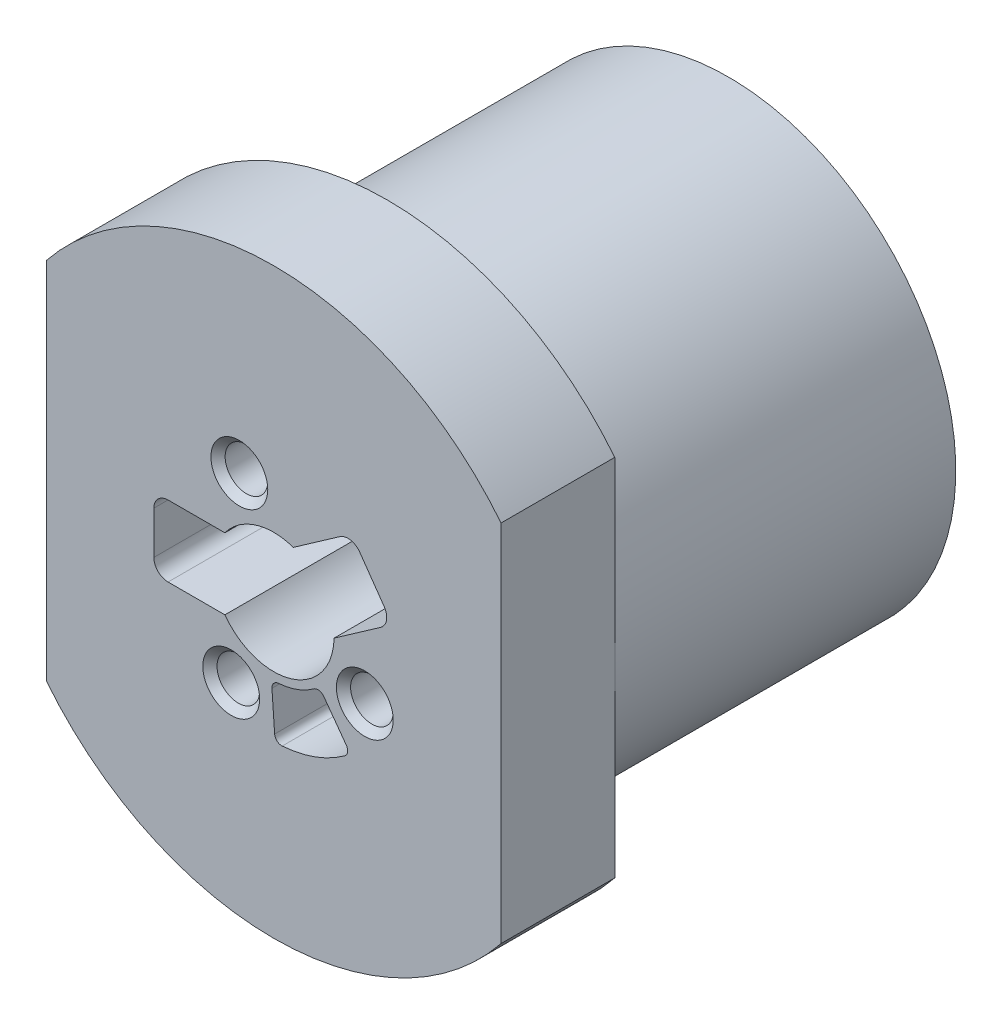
from build123d import *

# Parameters (mm, degrees)
ESQUISSE1_R             = 16
EXTRUSION1_DEPTH        = 24
ESQUISSE2_R             = 20.5
EXTRUSION2_DEPTH        = 8
ENL_V_START             = -8
ENL_V_MAT_EXTRU_1_DEPTH = 8
ENL_V_MAT_EXTRU_2_REACH = 43.234
ESQUISSE5_R             = 4
ENL_V_MAT_EXTRU_3_REACH = 43.234
ENL_V_MAT_EXTRU_4_DEPTH = 20
ENL_V_MAT_EXTRU_5_REACH = 43.234
ESQUISSE8_R             = 1.5
CHANFREIN1_SIZE         = 0.5
EXTRUSION3_START        = 4.36
EXTRUSION3_DEPTH        = 4.36


with BuildPart() as part:
    # Esquisse1 → Extrusion1 (new body)
    with BuildSketch(Plane.XY):
        Circle(ESQUISSE1_R)
    extrude(amount=EXTRUSION1_DEPTH)

    # Esquisse2 → Extrusion2 (add)
    with BuildSketch(Plane.XY.offset(24)):
        Circle(ESQUISSE2_R)
    extrude(amount=EXTRUSION2_DEPTH)

    # Esquisse4 → Enl_v. mat.-Extru.1 (cut)
    with BuildSketch(Plane.XY.offset(32).offset(ENL_V_START)):
        with BuildLine():
            Line((-16, 12.816005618), (-16, -12.816005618))
            ThreePointArc((-16, -12.816005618), (-20.5, 0), (-16, 12.816005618))
        make_face()
        with BuildLine():
            Line((16, 12.816005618), (16, -12.816005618))
            ThreePointArc((16, -12.816005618), (20.5, 0), (16, 12.816005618))
        make_face()
    extrude(amount=ENL_V_MAT_EXTRU_1_DEPTH, mode=Mode.SUBTRACT)

    # Esquisse5 → Enl_v. mat.-Extru.2 (cut, up to next)
    with BuildSketch(Plane(origin=(0, 0, 0), x_dir=(-1, 0, 0), z_dir=(0, 0, -1)), mode=Mode.PRIVATE) as enl_v_mat_extru_2_sk1:
        Circle(ESQUISSE5_R)
    enl_v_mat_extru_2_tool1 = extrude(enl_v_mat_extru_2_sk1.sketch, amount=-ENL_V_MAT_EXTRU_2_REACH, mode=Mode.PRIVATE) & part.part
    add(enl_v_mat_extru_2_tool1.solids().sort_by_distance((0, 0, 0))[0], mode=Mode.SUBTRACT)

    # Esquisse6 → Enl_v. mat.-Extru.3 (cut, up to next)
    with BuildSketch(Plane(origin=(0, 0, 0), x_dir=(-1, 0, 0), z_dir=(0, 0, -1)), mode=Mode.PRIVATE) as enl_v_mat_extru_3_sk1:
        with BuildLine():
            Line((-4.705067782, -6.470111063), (-3.117107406, -4.286448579))
            ThreePointArc((-3.117107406, -4.286448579), (-1.814850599, -4.979590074), (-0.371985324, -5.28692982))
            Line((-0.371985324, -5.28692982), (-0.561487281, -7.980271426))
            ThreePointArc((-0.561487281, -7.980271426), (-2.739397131, -7.516362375), (-4.705067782, -6.470111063))
        make_face()
    enl_v_mat_extru_3_tool1 = extrude(enl_v_mat_extru_3_sk1.sketch, amount=-ENL_V_MAT_EXTRU_3_REACH, mode=Mode.PRIVATE) & part.part
    add(enl_v_mat_extru_3_tool1.solids().sort_by_distance((2.27852, -6.251807, 0))[0], mode=Mode.SUBTRACT)

    # Esquisse7 → Enl_v. mat.-Extru.4 (cut)
    with BuildSketch(Plane.XY.offset(32)):
        with BuildLine():
            Line((-7.436931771, -2.5), (-3.436931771, -2.5))
            ThreePointArc((-3.436931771, -2.5), (1.277999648, -4.053297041), (4.249310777, -0.076537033))
            Line((4.249310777, -0.076537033), (7.525918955, 2.217768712))
            ThreePointArc((7.525918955, 2.217768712), (7.937150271, 2.863272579), (7.771494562, 3.610497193))
            Line((7.771494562, 3.610497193), (6.050765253, 6.067953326))
            ThreePointArc((6.050765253, 6.067953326), (5.405261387, 6.479184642), (4.658036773, 6.313528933))
            Line((4.658036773, 6.313528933), (1.381428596, 4.019223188))
            ThreePointArc((1.381428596, 4.019223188), (-1.277999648, 4.053297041), (-3.436931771, 2.5))
            Line((-3.436931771, 2.5), (-7.436931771, 2.5))
            ThreePointArc((-7.436931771, 2.5), (-8.144038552, 2.207106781), (-8.436931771, 1.5))
            Line((-8.436931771, 1.5), (-8.436931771, -1.5))
            ThreePointArc((-8.436931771, -1.5), (-8.144038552, -2.207106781), (-7.436931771, -2.5))
        make_face()
        with BuildLine():
            Line((-0.12678164, -5.322022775), (0.062720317, -8.015364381))
            ThreePointArc((0.062720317, -8.015364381), (0.233620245, -8.357767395), (0.596580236, -8.47903839))
            ThreePointArc((0.596580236, -8.47903839), (2.910609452, -7.986135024), (4.999134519, -6.874493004))
            ThreePointArc((4.999134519, -6.874493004), (5.198945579, -6.548115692), (5.109449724, -6.176044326))
            Line((5.109449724, -6.176044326), (3.521489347, -3.992381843))
            ThreePointArc((3.521489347, -3.992381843), (3.195112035, -3.792570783), (2.823040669, -3.882066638))
            ThreePointArc((2.823040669, -3.882066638), (1.643638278, -4.509817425), (0.336892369, -4.788162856))
            ThreePointArc((0.336892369, -4.788162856), (-0.005510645, -4.959062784), (-0.12678164, -5.322022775))
        make_face()
    extrude(amount=-ENL_V_MAT_EXTRU_4_DEPTH, mode=Mode.SUBTRACT)

    # Esquisse8 → Enl_v. mat.-Extru.5 (cut, up to next)
    with BuildSketch(Plane(origin=(0, 0, 0), x_dir=(-1, 0, 0), z_dir=(0, 0, -1)), mode=Mode.PRIVATE) as enl_v_mat_extru_5_sk1:
        with Locations((2.99, -6.41)):
            Circle(ESQUISSE8_R)
    enl_v_mat_extru_5_tool1 = extrude(enl_v_mat_extru_5_sk1.sketch, amount=-ENL_V_MAT_EXTRU_5_REACH, mode=Mode.PRIVATE) & part.part
    # Esquisse8 → Enl_v. mat.-Extru.5 (cut, up to next)
    with BuildSketch(Plane(origin=(0, 0, 0), x_dir=(-1, 0, 0), z_dir=(0, 0, -1)), mode=Mode.PRIVATE) as enl_v_mat_extru_5_sk2:
        with Locations((2.42, 6.64)):
            Circle(ESQUISSE8_R)
    enl_v_mat_extru_5_tool2 = extrude(enl_v_mat_extru_5_sk2.sketch, amount=-ENL_V_MAT_EXTRU_5_REACH, mode=Mode.PRIVATE) & part.part
    # Esquisse8 → Enl_v. mat.-Extru.5 (cut, up to next)
    with BuildSketch(Plane(origin=(0, 0, 0), x_dir=(-1, 0, 0), z_dir=(0, 0, -1)), mode=Mode.PRIVATE) as enl_v_mat_extru_5_sk3:
        with Locations((-6.41, -2.99)):
            Circle(ESQUISSE8_R)
    enl_v_mat_extru_5_tool3 = extrude(enl_v_mat_extru_5_sk3.sketch, amount=-ENL_V_MAT_EXTRU_5_REACH, mode=Mode.PRIVATE) & part.part
    add(enl_v_mat_extru_5_tool1.solids().sort_by_distance((-2.99, -6.41, 0))[0], mode=Mode.SUBTRACT)
    add(enl_v_mat_extru_5_tool2.solids().sort_by_distance((-2.42, 6.64, 0))[0], mode=Mode.SUBTRACT)
    add(enl_v_mat_extru_5_tool3.solids().sort_by_distance((6.41, -2.99, 0))[0], mode=Mode.SUBTRACT)

    # Chanfrein1
    chanfrein1_edges = [part.edges().sort_by_distance(p)[0] for p in [
        (-1.49, -6.41, 32),
        (-0.92, 6.64, 32),
        (7.91, -2.99, 32),
    ]]
    chamfer(chanfrein1_edges, length=CHANFREIN1_SIZE)

    # Esquisse9 → Extrusion3 (add)
    with BuildSketch(Plane(origin=(0, 0, 0), x_dir=(-1, 0, 0), z_dir=(0, 0, -1)).offset(EXTRUSION3_START)):
        with BuildLine():
            Line((5.910980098, -2.758410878), (9.57466916, -1.640033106))
            ThreePointArc((9.57466916, -1.640033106), (9.916790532, -1.270247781), (9.763414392, -0.79038949))
            Line((9.763414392, -0.79038949), (7.102542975, 1.607544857))
            Line((7.102542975, 1.607544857), (13.455584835, 8.657207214))
            ThreePointArc((13.455584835, 8.657207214), (15.68902569, -3.139183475), (9.088620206, -13.168028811))
            Line((9.088620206, -13.168028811), (5.910980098, -2.758410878))
        make_face()
    extrude(amount=-EXTRUSION3_DEPTH)


solid = part.part
